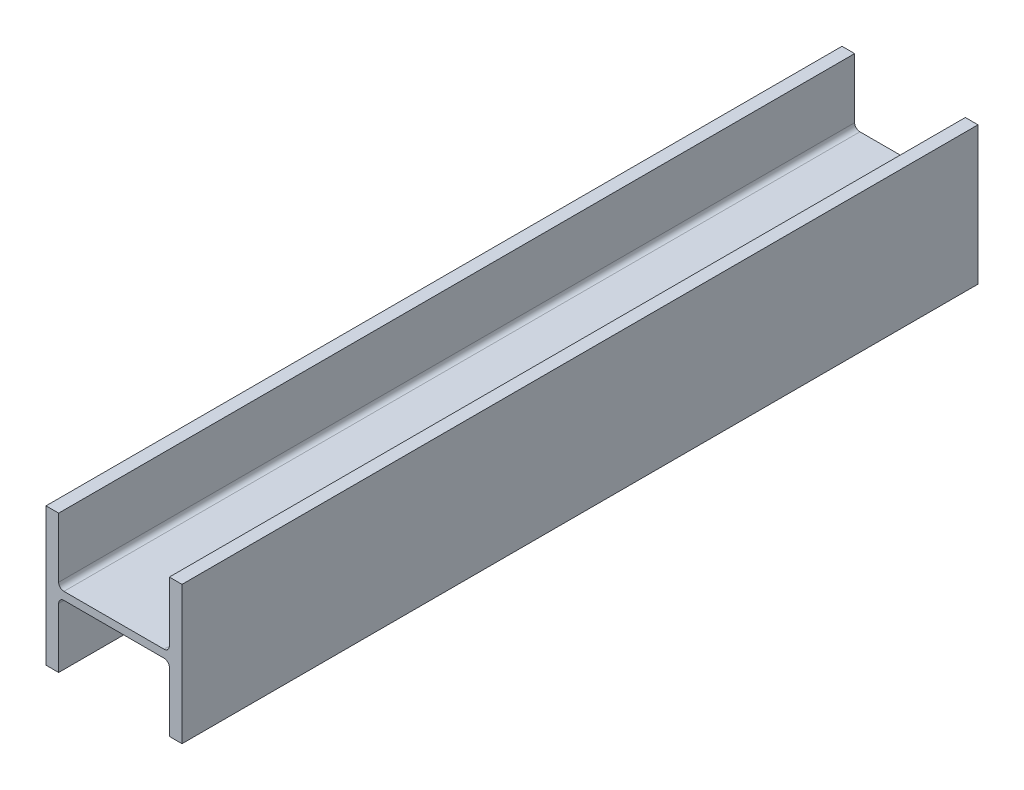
ISO-10303-21;
HEADER;
FILE_DESCRIPTION(('STEP AP214'),'2;1');
FILE_NAME('part.step','',(''),(''),'','','');
FILE_SCHEMA(('AUTOMOTIVE_DESIGN { 1 0 10303 214 1 1 1 1 }'));
ENDSEC;
DATA;
#1=APPLICATION_CONTEXT('core data for automotive mechanical design processes');
#2=APPLICATION_PROTOCOL_DEFINITION('international standard','automotive_design',2000,#1);
#3=PRODUCT_CONTEXT('',#1,'mechanical');
#4=PRODUCT('Part','Part','',(#3));
#5=PRODUCT_RELATED_PRODUCT_CATEGORY('part','',(#4));
#6=PRODUCT_DEFINITION_FORMATION('','',#4);
#7=PRODUCT_DEFINITION_CONTEXT('part definition',#1,'design');
#8=PRODUCT_DEFINITION('design','',#6,#7);
#9=PRODUCT_DEFINITION_SHAPE('','',#8);
#10=(LENGTH_UNIT() NAMED_UNIT(*) SI_UNIT(.MILLI.,.METRE.));
#11=(NAMED_UNIT(*) PLANE_ANGLE_UNIT() SI_UNIT($,.RADIAN.));
#12=(NAMED_UNIT(*) SI_UNIT($,.STERADIAN.) SOLID_ANGLE_UNIT());
#13=UNCERTAINTY_MEASURE_WITH_UNIT(LENGTH_MEASURE(1.E-05),#10,'distance_accuracy_value','');
#14=(GEOMETRIC_REPRESENTATION_CONTEXT(3) GLOBAL_UNCERTAINTY_ASSIGNED_CONTEXT((#13)) GLOBAL_UNIT_ASSIGNED_CONTEXT((#10,
#11,#12)) REPRESENTATION_CONTEXT('',''));
#15=CARTESIAN_POINT('',(0.,0.,0.));
#16=DIRECTION('',(0.,0.,1.));
#17=DIRECTION('',(1.,0.,0.));
#18=AXIS2_PLACEMENT_3D('',#15,#16,#17);
#19=CARTESIAN_POINT('',(196.596,199.517,1150.6));
#20=DIRECTION('',(-1.,0.,0.));
#21=DIRECTION('',(0.,0.,1.));
#22=AXIS2_PLACEMENT_3D('',#19,#20,#21);
#23=PLANE('',#22);
#24=DIRECTION('',(0.,1.,0.));
#25=VECTOR('',#24,1.);
#26=CARTESIAN_POINT('',(196.596,199.517,-1150.6));
#27=LINE('',#26,#25);
#28=CARTESIAN_POINT('',(196.596,-199.517,-1150.6));
#29=VERTEX_POINT('',#28);
#30=CARTESIAN_POINT('',(196.596,199.517,-1150.6));
#31=VERTEX_POINT('',#30);
#32=EDGE_CURVE('E191',#29,#31,#27,.T.);
#33=ORIENTED_EDGE('',*,*,#32,.T.);
#34=DIRECTION('',(0.,0.,-1.));
#35=VECTOR('',#34,1.);
#36=CARTESIAN_POINT('',(196.596,199.517,1150.6));
#37=LINE('',#36,#35);
#38=CARTESIAN_POINT('',(196.596,199.517,1150.6));
#39=VERTEX_POINT('',#38);
#40=EDGE_CURVE('E11',#39,#31,#37,.T.);
#41=ORIENTED_EDGE('',*,*,#40,.F.);
#42=DIRECTION('',(0.,1.,0.));
#43=VECTOR('',#42,1.);
#44=CARTESIAN_POINT('',(196.596,199.517,1150.6));
#45=LINE('',#44,#43);
#46=CARTESIAN_POINT('',(196.596,-199.517,1150.6));
#47=VERTEX_POINT('',#46);
#48=EDGE_CURVE('E238',#47,#39,#45,.T.);
#49=ORIENTED_EDGE('',*,*,#48,.F.);
#50=DIRECTION('',(0.,0.,-1.));
#51=VECTOR('',#50,1.);
#52=CARTESIAN_POINT('',(196.596,-199.517,1150.6));
#53=LINE('',#52,#51);
#54=EDGE_CURVE('E188',#47,#29,#53,.T.);
#55=ORIENTED_EDGE('',*,*,#54,.T.);
#56=EDGE_LOOP('',(#33,#41,#49,#55));
#57=FACE_BOUND('',#56,.T.);
#58=ADVANCED_FACE('F44',(#57),#23,.F.);
#59=CARTESIAN_POINT('',(160.02,199.517,1150.6));
#60=DIRECTION('',(0.,-1.,0.));
#61=DIRECTION('',(0.,0.,-1.));
#62=AXIS2_PLACEMENT_3D('',#59,#60,#61);
#63=PLANE('',#62);
#64=DIRECTION('',(-1.,0.,0.));
#65=VECTOR('',#64,1.);
#66=CARTESIAN_POINT('',(160.02,199.517,-1150.6));
#67=LINE('',#66,#65);
#68=CARTESIAN_POINT('',(160.02,199.517,-1150.6));
#69=VERTEX_POINT('',#68);
#70=EDGE_CURVE('E196',#31,#69,#67,.T.);
#71=ORIENTED_EDGE('',*,*,#70,.T.);
#72=DIRECTION('',(0.,0.,-1.));
#73=VECTOR('',#72,1.);
#74=CARTESIAN_POINT('',(160.02,199.517,1150.6));
#75=LINE('',#74,#73);
#76=CARTESIAN_POINT('',(160.02,199.517,1150.6));
#77=VERTEX_POINT('',#76);
#78=EDGE_CURVE('E53',#77,#69,#75,.T.);
#79=ORIENTED_EDGE('',*,*,#78,.F.);
#80=DIRECTION('',(-1.,0.,0.));
#81=VECTOR('',#80,1.);
#82=CARTESIAN_POINT('',(160.02,199.517,1150.6));
#83=LINE('',#82,#81);
#84=EDGE_CURVE('E129',#39,#77,#83,.T.);
#85=ORIENTED_EDGE('',*,*,#84,.F.);
#86=ORIENTED_EDGE('',*,*,#40,.T.);
#87=EDGE_LOOP('',(#71,#79,#85,#86));
#88=FACE_BOUND('',#87,.T.);
#89=ADVANCED_FACE('F362',(#88),#63,.F.);
#90=CARTESIAN_POINT('',(160.02,26.5430000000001,1150.6));
#91=DIRECTION('',(1.,0.,0.));
#92=DIRECTION('',(0.,0.,-1.));
#93=AXIS2_PLACEMENT_3D('',#90,#91,#92);
#94=PLANE('',#93);
#95=DIRECTION('',(0.,-1.,0.));
#96=VECTOR('',#95,1.);
#97=CARTESIAN_POINT('',(160.02,26.5430000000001,-1150.6));
#98=LINE('',#97,#96);
#99=CARTESIAN_POINT('',(160.02,26.5430000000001,-1150.6));
#100=VERTEX_POINT('',#99);
#101=EDGE_CURVE('E203',#69,#100,#98,.T.);
#102=ORIENTED_EDGE('',*,*,#101,.T.);
#103=DIRECTION('',(0.,0.,-1.));
#104=VECTOR('',#103,1.);
#105=CARTESIAN_POINT('',(160.02,26.5430000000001,1150.6));
#106=LINE('',#105,#104);
#107=CARTESIAN_POINT('',(160.02,26.5430000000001,1150.6));
#108=VERTEX_POINT('',#107);
#109=EDGE_CURVE('E285',#108,#100,#106,.T.);
#110=ORIENTED_EDGE('',*,*,#109,.F.);
#111=DIRECTION('',(0.,-1.,0.));
#112=VECTOR('',#111,1.);
#113=CARTESIAN_POINT('',(160.02,26.5430000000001,1150.6));
#114=LINE('',#113,#112);
#115=EDGE_CURVE('E291',#77,#108,#114,.T.);
#116=ORIENTED_EDGE('',*,*,#115,.F.);
#117=ORIENTED_EDGE('',*,*,#78,.T.);
#118=EDGE_LOOP('',(#102,#110,#116,#117));
#119=FACE_BOUND('',#118,.T.);
#120=ADVANCED_FACE('F292',(#119),#94,.F.);
#121=CARTESIAN_POINT('',(144.78,26.5430000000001,1150.6));
#122=DIRECTION('',(0.,0.,-1.));
#123=DIRECTION('',(-1.,0.,0.));
#124=AXIS2_PLACEMENT_3D('',#121,#122,#123);
#125=CYLINDRICAL_SURFACE('',#124,15.24);
#126=CARTESIAN_POINT('',(144.78,26.5430000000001,-1150.6));
#127=DIRECTION('',(0.,0.,-1.));
#128=DIRECTION('',(1.,0.,0.));
#129=AXIS2_PLACEMENT_3D('',#126,#127,#128);
#130=CIRCLE('',#129,15.24);
#131=CARTESIAN_POINT('',(144.78,11.3030000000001,-1150.6));
#132=VERTEX_POINT('',#131);
#133=EDGE_CURVE('E204',#100,#132,#130,.T.);
#134=ORIENTED_EDGE('',*,*,#133,.T.);
#135=DIRECTION('',(0.,0.,-1.));
#136=VECTOR('',#135,1.);
#137=CARTESIAN_POINT('',(144.78,11.3030000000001,1150.6));
#138=LINE('',#137,#136);
#139=CARTESIAN_POINT('',(144.78,11.3030000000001,1150.6));
#140=VERTEX_POINT('',#139);
#141=EDGE_CURVE('E276',#140,#132,#138,.T.);
#142=ORIENTED_EDGE('',*,*,#141,.F.);
#143=CARTESIAN_POINT('',(144.78,26.5430000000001,1150.6));
#144=DIRECTION('',(0.,0.,-1.));
#145=DIRECTION('',(1.,0.,0.));
#146=AXIS2_PLACEMENT_3D('',#143,#144,#145);
#147=CIRCLE('',#146,15.24);
#148=EDGE_CURVE('E315',#108,#140,#147,.T.);
#149=ORIENTED_EDGE('',*,*,#148,.F.);
#150=ORIENTED_EDGE('',*,*,#109,.T.);
#151=EDGE_LOOP('',(#134,#142,#149,#150));
#152=FACE_BOUND('',#151,.T.);
#153=ADVANCED_FACE('F304',(#152),#125,.F.);
#154=CARTESIAN_POINT('',(-144.78,11.3030000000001,1150.6));
#155=DIRECTION('',(0.,-1.,0.));
#156=DIRECTION('',(1.,0.,0.));
#157=AXIS2_PLACEMENT_3D('',#154,#155,#156);
#158=PLANE('',#157);
#159=DIRECTION('',(-1.,0.,0.));
#160=VECTOR('',#159,1.);
#161=CARTESIAN_POINT('',(-144.78,11.3030000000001,-1150.6));
#162=LINE('',#161,#160);
#163=CARTESIAN_POINT('',(-144.78,11.3030000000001,-1150.6));
#164=VERTEX_POINT('',#163);
#165=EDGE_CURVE('E210',#132,#164,#162,.T.);
#166=ORIENTED_EDGE('',*,*,#165,.T.);
#167=DIRECTION('',(0.,0.,-1.));
#168=VECTOR('',#167,1.);
#169=CARTESIAN_POINT('',(-144.78,11.3030000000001,1150.6));
#170=LINE('',#169,#168);
#171=CARTESIAN_POINT('',(-144.78,11.3030000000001,1150.6));
#172=VERTEX_POINT('',#171);
#173=EDGE_CURVE('E274',#172,#164,#170,.T.);
#174=ORIENTED_EDGE('',*,*,#173,.F.);
#175=DIRECTION('',(-1.,0.,0.));
#176=VECTOR('',#175,1.);
#177=CARTESIAN_POINT('',(-144.78,11.3030000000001,1150.6));
#178=LINE('',#177,#176);
#179=EDGE_CURVE('E306',#140,#172,#178,.T.);
#180=ORIENTED_EDGE('',*,*,#179,.F.);
#181=ORIENTED_EDGE('',*,*,#141,.T.);
#182=EDGE_LOOP('',(#166,#174,#180,#181));
#183=FACE_BOUND('',#182,.T.);
#184=ADVANCED_FACE('F308',(#183),#158,.F.);
#185=CARTESIAN_POINT('',(-144.78,26.5430000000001,1150.6));
#186=DIRECTION('',(0.,0.,-1.));
#187=DIRECTION('',(-1.,0.,0.));
#188=AXIS2_PLACEMENT_3D('',#185,#186,#187);
#189=CYLINDRICAL_SURFACE('',#188,15.24);
#190=CARTESIAN_POINT('',(-144.78,26.5430000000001,-1150.6));
#191=DIRECTION('',(0.,0.,-1.));
#192=DIRECTION('',(1.,0.,0.));
#193=AXIS2_PLACEMENT_3D('',#190,#191,#192);
#194=CIRCLE('',#193,15.24);
#195=CARTESIAN_POINT('',(-160.02,26.5430000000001,-1150.6));
#196=VERTEX_POINT('',#195);
#197=EDGE_CURVE('E209',#164,#196,#194,.T.);
#198=ORIENTED_EDGE('',*,*,#197,.T.);
#199=DIRECTION('',(0.,0.,-1.));
#200=VECTOR('',#199,1.);
#201=CARTESIAN_POINT('',(-160.02,26.5430000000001,1150.6));
#202=LINE('',#201,#200);
#203=CARTESIAN_POINT('',(-160.02,26.5430000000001,1150.6));
#204=VERTEX_POINT('',#203);
#205=EDGE_CURVE('E271',#204,#196,#202,.T.);
#206=ORIENTED_EDGE('',*,*,#205,.F.);
#207=CARTESIAN_POINT('',(-144.78,26.5430000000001,1150.6));
#208=DIRECTION('',(0.,0.,-1.));
#209=DIRECTION('',(1.,0.,0.));
#210=AXIS2_PLACEMENT_3D('',#207,#208,#209);
#211=CIRCLE('',#210,15.24);
#212=EDGE_CURVE('E313',#172,#204,#211,.T.);
#213=ORIENTED_EDGE('',*,*,#212,.F.);
#214=ORIENTED_EDGE('',*,*,#173,.T.);
#215=EDGE_LOOP('',(#198,#206,#213,#214));
#216=FACE_BOUND('',#215,.T.);
#217=ADVANCED_FACE('F374',(#216),#189,.F.);
#218=CARTESIAN_POINT('',(-160.02,199.517,1150.6));
#219=DIRECTION('',(-1.,0.,0.));
#220=DIRECTION('',(0.,0.,1.));
#221=AXIS2_PLACEMENT_3D('',#218,#219,#220);
#222=PLANE('',#221);
#223=DIRECTION('',(0.,1.,0.));
#224=VECTOR('',#223,1.);
#225=CARTESIAN_POINT('',(-160.02,199.517,-1150.6));
#226=LINE('',#225,#224);
#227=CARTESIAN_POINT('',(-160.02,199.517,-1150.6));
#228=VERTEX_POINT('',#227);
#229=EDGE_CURVE('E213',#196,#228,#226,.T.);
#230=ORIENTED_EDGE('',*,*,#229,.T.);
#231=DIRECTION('',(0.,0.,-1.));
#232=VECTOR('',#231,1.);
#233=CARTESIAN_POINT('',(-160.02,199.517,1150.6));
#234=LINE('',#233,#232);
#235=CARTESIAN_POINT('',(-160.02,199.517,1150.6));
#236=VERTEX_POINT('',#235);
#237=EDGE_CURVE('E270',#236,#228,#234,.T.);
#238=ORIENTED_EDGE('',*,*,#237,.F.);
#239=DIRECTION('',(0.,1.,0.));
#240=VECTOR('',#239,1.);
#241=CARTESIAN_POINT('',(-160.02,199.517,1150.6));
#242=LINE('',#241,#240);
#243=EDGE_CURVE('E316',#204,#236,#242,.T.);
#244=ORIENTED_EDGE('',*,*,#243,.F.);
#245=ORIENTED_EDGE('',*,*,#205,.T.);
#246=EDGE_LOOP('',(#230,#238,#244,#245));
#247=FACE_BOUND('',#246,.T.);
#248=ADVANCED_FACE('F378',(#247),#222,.F.);
#249=CARTESIAN_POINT('',(-196.596,199.517,1150.6));
#250=DIRECTION('',(0.,-1.,0.));
#251=DIRECTION('',(1.,0.,0.));
#252=AXIS2_PLACEMENT_3D('',#249,#250,#251);
#253=PLANE('',#252);
#254=DIRECTION('',(-1.,0.,0.));
#255=VECTOR('',#254,1.);
#256=CARTESIAN_POINT('',(-196.596,199.517,-1150.6));
#257=LINE('',#256,#255);
#258=CARTESIAN_POINT('',(-196.596,199.517,-1150.6));
#259=VERTEX_POINT('',#258);
#260=EDGE_CURVE('E216',#228,#259,#257,.T.);
#261=ORIENTED_EDGE('',*,*,#260,.T.);
#262=DIRECTION('',(0.,0.,-1.));
#263=VECTOR('',#262,1.);
#264=CARTESIAN_POINT('',(-196.596,199.517,1150.6));
#265=LINE('',#264,#263);
#266=CARTESIAN_POINT('',(-196.596,199.517,1150.6));
#267=VERTEX_POINT('',#266);
#268=EDGE_CURVE('E263',#267,#259,#265,.T.);
#269=ORIENTED_EDGE('',*,*,#268,.F.);
#270=DIRECTION('',(-1.,0.,0.));
#271=VECTOR('',#270,1.);
#272=CARTESIAN_POINT('',(-196.596,199.517,1150.6));
#273=LINE('',#272,#271);
#274=EDGE_CURVE('E323',#236,#267,#273,.T.);
#275=ORIENTED_EDGE('',*,*,#274,.F.);
#276=ORIENTED_EDGE('',*,*,#237,.T.);
#277=EDGE_LOOP('',(#261,#269,#275,#276));
#278=FACE_BOUND('',#277,.T.);
#279=ADVANCED_FACE('F385',(#278),#253,.F.);
#280=CARTESIAN_POINT('',(-196.596,-199.517,1150.6));
#281=DIRECTION('',(1.,0.,0.));
#282=DIRECTION('',(0.,0.,-1.));
#283=AXIS2_PLACEMENT_3D('',#280,#281,#282);
#284=PLANE('',#283);
#285=DIRECTION('',(0.,-1.,0.));
#286=VECTOR('',#285,1.);
#287=CARTESIAN_POINT('',(-196.596,-199.517,-1150.6));
#288=LINE('',#287,#286);
#289=CARTESIAN_POINT('',(-196.596,-199.517,-1150.6));
#290=VERTEX_POINT('',#289);
#291=EDGE_CURVE('E218',#259,#290,#288,.T.);
#292=ORIENTED_EDGE('',*,*,#291,.T.);
#293=DIRECTION('',(0.,0.,-1.));
#294=VECTOR('',#293,1.);
#295=CARTESIAN_POINT('',(-196.596,-199.517,1150.6));
#296=LINE('',#295,#294);
#297=CARTESIAN_POINT('',(-196.596,-199.517,1150.6));
#298=VERTEX_POINT('',#297);
#299=EDGE_CURVE('E259',#298,#290,#296,.T.);
#300=ORIENTED_EDGE('',*,*,#299,.F.);
#301=DIRECTION('',(0.,-1.,0.));
#302=VECTOR('',#301,1.);
#303=CARTESIAN_POINT('',(-196.596,-199.517,1150.6));
#304=LINE('',#303,#302);
#305=EDGE_CURVE('E326',#267,#298,#304,.T.);
#306=ORIENTED_EDGE('',*,*,#305,.F.);
#307=ORIENTED_EDGE('',*,*,#268,.T.);
#308=EDGE_LOOP('',(#292,#300,#306,#307));
#309=FACE_BOUND('',#308,.T.);
#310=ADVANCED_FACE('F387',(#309),#284,.F.);
#311=CARTESIAN_POINT('',(-160.02,-199.517,1150.6));
#312=DIRECTION('',(0.,1.,0.));
#313=DIRECTION('',(0.,0.,1.));
#314=AXIS2_PLACEMENT_3D('',#311,#312,#313);
#315=PLANE('',#314);
#316=DIRECTION('',(1.,0.,0.));
#317=VECTOR('',#316,1.);
#318=CARTESIAN_POINT('',(-160.02,-199.517,-1150.6));
#319=LINE('',#318,#317);
#320=CARTESIAN_POINT('',(-160.02,-199.517,-1150.6));
#321=VERTEX_POINT('',#320);
#322=EDGE_CURVE('E225',#290,#321,#319,.T.);
#323=ORIENTED_EDGE('',*,*,#322,.T.);
#324=DIRECTION('',(0.,0.,-1.));
#325=VECTOR('',#324,1.);
#326=CARTESIAN_POINT('',(-160.02,-199.517,1150.6));
#327=LINE('',#326,#325);
#328=CARTESIAN_POINT('',(-160.02,-199.517,1150.6));
#329=VERTEX_POINT('',#328);
#330=EDGE_CURVE('E254',#329,#321,#327,.T.);
#331=ORIENTED_EDGE('',*,*,#330,.F.);
#332=DIRECTION('',(1.,0.,0.));
#333=VECTOR('',#332,1.);
#334=CARTESIAN_POINT('',(-160.02,-199.517,1150.6));
#335=LINE('',#334,#333);
#336=EDGE_CURVE('E328',#298,#329,#335,.T.);
#337=ORIENTED_EDGE('',*,*,#336,.F.);
#338=ORIENTED_EDGE('',*,*,#299,.T.);
#339=EDGE_LOOP('',(#323,#331,#337,#338));
#340=FACE_BOUND('',#339,.T.);
#341=ADVANCED_FACE('F388',(#340),#315,.F.);
#342=CARTESIAN_POINT('',(-160.02,-26.5429999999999,1150.6));
#343=DIRECTION('',(-1.,0.,0.));
#344=DIRECTION('',(0.,0.,1.));
#345=AXIS2_PLACEMENT_3D('',#342,#343,#344);
#346=PLANE('',#345);
#347=DIRECTION('',(0.,1.,0.));
#348=VECTOR('',#347,1.);
#349=CARTESIAN_POINT('',(-160.02,-26.5429999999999,-1150.6));
#350=LINE('',#349,#348);
#351=CARTESIAN_POINT('',(-160.02,-26.5429999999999,-1150.6));
#352=VERTEX_POINT('',#351);
#353=EDGE_CURVE('E223',#321,#352,#350,.T.);
#354=ORIENTED_EDGE('',*,*,#353,.T.);
#355=DIRECTION('',(0.,0.,-1.));
#356=VECTOR('',#355,1.);
#357=CARTESIAN_POINT('',(-160.02,-26.5429999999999,1150.6));
#358=LINE('',#357,#356);
#359=CARTESIAN_POINT('',(-160.02,-26.5429999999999,1150.6));
#360=VERTEX_POINT('',#359);
#361=EDGE_CURVE('E253',#360,#352,#358,.T.);
#362=ORIENTED_EDGE('',*,*,#361,.F.);
#363=DIRECTION('',(0.,1.,0.));
#364=VECTOR('',#363,1.);
#365=CARTESIAN_POINT('',(-160.02,-26.5429999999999,1150.6));
#366=LINE('',#365,#364);
#367=EDGE_CURVE('E335',#329,#360,#366,.T.);
#368=ORIENTED_EDGE('',*,*,#367,.F.);
#369=ORIENTED_EDGE('',*,*,#330,.T.);
#370=EDGE_LOOP('',(#354,#362,#368,#369));
#371=FACE_BOUND('',#370,.T.);
#372=ADVANCED_FACE('F391',(#371),#346,.F.);
#373=CARTESIAN_POINT('',(-144.78,-26.5429999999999,1150.6));
#374=DIRECTION('',(0.,0.,-1.));
#375=DIRECTION('',(-1.,0.,0.));
#376=AXIS2_PLACEMENT_3D('',#373,#374,#375);
#377=CYLINDRICAL_SURFACE('',#376,15.24);
#378=CARTESIAN_POINT('',(-144.78,-26.5429999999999,-1150.6));
#379=DIRECTION('',(0.,0.,-1.));
#380=DIRECTION('',(1.,0.,0.));
#381=AXIS2_PLACEMENT_3D('',#378,#379,#380);
#382=CIRCLE('',#381,15.24);
#383=CARTESIAN_POINT('',(-144.78,-11.3029999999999,-1150.6));
#384=VERTEX_POINT('',#383);
#385=EDGE_CURVE('E230',#352,#384,#382,.T.);
#386=ORIENTED_EDGE('',*,*,#385,.T.);
#387=DIRECTION('',(0.,0.,-1.));
#388=VECTOR('',#387,1.);
#389=CARTESIAN_POINT('',(-144.78,-11.3029999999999,1150.6));
#390=LINE('',#389,#388);
#391=CARTESIAN_POINT('',(-144.78,-11.3029999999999,1150.6));
#392=VERTEX_POINT('',#391);
#393=EDGE_CURVE('E249',#392,#384,#390,.T.);
#394=ORIENTED_EDGE('',*,*,#393,.F.);
#395=CARTESIAN_POINT('',(-144.78,-26.5429999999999,1150.6));
#396=DIRECTION('',(0.,0.,-1.));
#397=DIRECTION('',(1.,0.,0.));
#398=AXIS2_PLACEMENT_3D('',#395,#396,#397);
#399=CIRCLE('',#398,15.24);
#400=EDGE_CURVE('E333',#360,#392,#399,.T.);
#401=ORIENTED_EDGE('',*,*,#400,.F.);
#402=ORIENTED_EDGE('',*,*,#361,.T.);
#403=EDGE_LOOP('',(#386,#394,#401,#402));
#404=FACE_BOUND('',#403,.T.);
#405=ADVANCED_FACE('F345',(#404),#377,.F.);
#406=CARTESIAN_POINT('',(144.78,-11.3029999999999,1150.6));
#407=DIRECTION('',(0.,1.,0.));
#408=DIRECTION('',(0.,0.,1.));
#409=AXIS2_PLACEMENT_3D('',#406,#407,#408);
#410=PLANE('',#409);
#411=DIRECTION('',(1.,0.,0.));
#412=VECTOR('',#411,1.);
#413=CARTESIAN_POINT('',(144.78,-11.3029999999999,-1150.6));
#414=LINE('',#413,#412);
#415=CARTESIAN_POINT('',(144.78,-11.3029999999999,-1150.6));
#416=VERTEX_POINT('',#415);
#417=EDGE_CURVE('E232',#384,#416,#414,.T.);
#418=ORIENTED_EDGE('',*,*,#417,.T.);
#419=DIRECTION('',(0.,0.,-1.));
#420=VECTOR('',#419,1.);
#421=CARTESIAN_POINT('',(144.78,-11.3029999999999,1150.6));
#422=LINE('',#421,#420);
#423=CARTESIAN_POINT('',(144.78,-11.3029999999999,1150.6));
#424=VERTEX_POINT('',#423);
#425=EDGE_CURVE('E181',#424,#416,#422,.T.);
#426=ORIENTED_EDGE('',*,*,#425,.F.);
#427=DIRECTION('',(1.,0.,0.));
#428=VECTOR('',#427,1.);
#429=CARTESIAN_POINT('',(144.78,-11.3029999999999,1150.6));
#430=LINE('',#429,#428);
#431=EDGE_CURVE('E174',#392,#424,#430,.T.);
#432=ORIENTED_EDGE('',*,*,#431,.F.);
#433=ORIENTED_EDGE('',*,*,#393,.T.);
#434=EDGE_LOOP('',(#418,#426,#432,#433));
#435=FACE_BOUND('',#434,.T.);
#436=ADVANCED_FACE('F350',(#435),#410,.F.);
#437=CARTESIAN_POINT('',(144.78,-26.5429999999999,1150.6));
#438=DIRECTION('',(0.,0.,-1.));
#439=DIRECTION('',(-1.,0.,0.));
#440=AXIS2_PLACEMENT_3D('',#437,#438,#439);
#441=CYLINDRICAL_SURFACE('',#440,15.24);
#442=CARTESIAN_POINT('',(144.78,-26.5429999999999,-1150.6));
#443=DIRECTION('',(0.,0.,-1.));
#444=DIRECTION('',(1.,0.,0.));
#445=AXIS2_PLACEMENT_3D('',#442,#443,#444);
#446=CIRCLE('',#445,15.24);
#447=CARTESIAN_POINT('',(160.02,-26.5429999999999,-1150.6));
#448=VERTEX_POINT('',#447);
#449=EDGE_CURVE('E182',#416,#448,#446,.T.);
#450=ORIENTED_EDGE('',*,*,#449,.T.);
#451=DIRECTION('',(0.,0.,-1.));
#452=VECTOR('',#451,1.);
#453=CARTESIAN_POINT('',(160.02,-26.5429999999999,1150.6));
#454=LINE('',#453,#452);
#455=CARTESIAN_POINT('',(160.02,-26.5429999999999,1150.6));
#456=VERTEX_POINT('',#455);
#457=EDGE_CURVE('E180',#456,#448,#454,.T.);
#458=ORIENTED_EDGE('',*,*,#457,.F.);
#459=CARTESIAN_POINT('',(144.78,-26.5429999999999,1150.6));
#460=DIRECTION('',(0.,0.,-1.));
#461=DIRECTION('',(1.,0.,0.));
#462=AXIS2_PLACEMENT_3D('',#459,#460,#461);
#463=CIRCLE('',#462,15.24);
#464=EDGE_CURVE('E167',#424,#456,#463,.T.);
#465=ORIENTED_EDGE('',*,*,#464,.F.);
#466=ORIENTED_EDGE('',*,*,#425,.T.);
#467=EDGE_LOOP('',(#450,#458,#465,#466));
#468=FACE_BOUND('',#467,.T.);
#469=ADVANCED_FACE('F176',(#468),#441,.F.);
#470=CARTESIAN_POINT('',(160.02,-199.517,1150.6));
#471=DIRECTION('',(1.,0.,0.));
#472=DIRECTION('',(0.,0.,-1.));
#473=AXIS2_PLACEMENT_3D('',#470,#471,#472);
#474=PLANE('',#473);
#475=DIRECTION('',(0.,-1.,0.));
#476=VECTOR('',#475,1.);
#477=CARTESIAN_POINT('',(160.02,-199.517,-1150.6));
#478=LINE('',#477,#476);
#479=CARTESIAN_POINT('',(160.02,-199.517,-1150.6));
#480=VERTEX_POINT('',#479);
#481=EDGE_CURVE('E113',#448,#480,#478,.T.);
#482=ORIENTED_EDGE('',*,*,#481,.T.);
#483=DIRECTION('',(0.,0.,-1.));
#484=VECTOR('',#483,1.);
#485=CARTESIAN_POINT('',(160.02,-199.517,1150.6));
#486=LINE('',#485,#484);
#487=CARTESIAN_POINT('',(160.02,-199.517,1150.6));
#488=VERTEX_POINT('',#487);
#489=EDGE_CURVE('E184',#488,#480,#486,.T.);
#490=ORIENTED_EDGE('',*,*,#489,.F.);
#491=DIRECTION('',(0.,-1.,0.));
#492=VECTOR('',#491,1.);
#493=CARTESIAN_POINT('',(160.02,-199.517,1150.6));
#494=LINE('',#493,#492);
#495=EDGE_CURVE('E168',#456,#488,#494,.T.);
#496=ORIENTED_EDGE('',*,*,#495,.F.);
#497=ORIENTED_EDGE('',*,*,#457,.T.);
#498=EDGE_LOOP('',(#482,#490,#496,#497));
#499=FACE_BOUND('',#498,.T.);
#500=ADVANCED_FACE('F187',(#499),#474,.F.);
#501=CARTESIAN_POINT('',(196.596,-199.517,1150.6));
#502=DIRECTION('',(0.,1.,0.));
#503=DIRECTION('',(0.,0.,1.));
#504=AXIS2_PLACEMENT_3D('',#501,#502,#503);
#505=PLANE('',#504);
#506=DIRECTION('',(1.,0.,0.));
#507=VECTOR('',#506,1.);
#508=CARTESIAN_POINT('',(196.596,-199.517,-1150.6));
#509=LINE('',#508,#507);
#510=EDGE_CURVE('E122',#480,#29,#509,.T.);
#511=ORIENTED_EDGE('',*,*,#510,.T.);
#512=ORIENTED_EDGE('',*,*,#54,.F.);
#513=DIRECTION('',(1.,0.,0.));
#514=VECTOR('',#513,1.);
#515=CARTESIAN_POINT('',(196.596,-199.517,1150.6));
#516=LINE('',#515,#514);
#517=EDGE_CURVE('E64',#488,#47,#516,.T.);
#518=ORIENTED_EDGE('',*,*,#517,.F.);
#519=ORIENTED_EDGE('',*,*,#489,.T.);
#520=EDGE_LOOP('',(#511,#512,#518,#519));
#521=FACE_BOUND('',#520,.T.);
#522=ADVANCED_FACE('F352',(#521),#505,.F.);
#523=CARTESIAN_POINT('',(144.78,-26.5429999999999,1150.6));
#524=DIRECTION('',(0.,0.,1.));
#525=DIRECTION('',(1.,0.,0.));
#526=AXIS2_PLACEMENT_3D('',#523,#524,#525);
#527=PLANE('',#526);
#528=ORIENTED_EDGE('',*,*,#48,.T.);
#529=ORIENTED_EDGE('',*,*,#84,.T.);
#530=ORIENTED_EDGE('',*,*,#115,.T.);
#531=ORIENTED_EDGE('',*,*,#148,.T.);
#532=ORIENTED_EDGE('',*,*,#179,.T.);
#533=ORIENTED_EDGE('',*,*,#212,.T.);
#534=ORIENTED_EDGE('',*,*,#243,.T.);
#535=ORIENTED_EDGE('',*,*,#274,.T.);
#536=ORIENTED_EDGE('',*,*,#305,.T.);
#537=ORIENTED_EDGE('',*,*,#336,.T.);
#538=ORIENTED_EDGE('',*,*,#367,.T.);
#539=ORIENTED_EDGE('',*,*,#400,.T.);
#540=ORIENTED_EDGE('',*,*,#431,.T.);
#541=ORIENTED_EDGE('',*,*,#464,.T.);
#542=ORIENTED_EDGE('',*,*,#495,.T.);
#543=ORIENTED_EDGE('',*,*,#517,.T.);
#544=EDGE_LOOP('',(#528,#529,#530,#531,#532,#533,#534,#535,#536,#537,#538,#539,#540,#541,#542,#543));
#545=FACE_BOUND('',#544,.T.);
#546=ADVANCED_FACE('F169',(#545),#527,.T.);
#547=CARTESIAN_POINT('',(144.78,-26.5429999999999,-1150.6));
#548=DIRECTION('',(0.,0.,1.));
#549=DIRECTION('',(1.,0.,0.));
#550=AXIS2_PLACEMENT_3D('',#547,#548,#549);
#551=PLANE('',#550);
#552=ORIENTED_EDGE('',*,*,#32,.F.);
#553=ORIENTED_EDGE('',*,*,#510,.F.);
#554=ORIENTED_EDGE('',*,*,#481,.F.);
#555=ORIENTED_EDGE('',*,*,#449,.F.);
#556=ORIENTED_EDGE('',*,*,#417,.F.);
#557=ORIENTED_EDGE('',*,*,#385,.F.);
#558=ORIENTED_EDGE('',*,*,#353,.F.);
#559=ORIENTED_EDGE('',*,*,#322,.F.);
#560=ORIENTED_EDGE('',*,*,#291,.F.);
#561=ORIENTED_EDGE('',*,*,#260,.F.);
#562=ORIENTED_EDGE('',*,*,#229,.F.);
#563=ORIENTED_EDGE('',*,*,#197,.F.);
#564=ORIENTED_EDGE('',*,*,#165,.F.);
#565=ORIENTED_EDGE('',*,*,#133,.F.);
#566=ORIENTED_EDGE('',*,*,#101,.F.);
#567=ORIENTED_EDGE('',*,*,#70,.F.);
#568=EDGE_LOOP('',(#552,#553,#554,#555,#556,#557,#558,#559,#560,#561,#562,#563,#564,#565,#566,#567));
#569=FACE_BOUND('',#568,.T.);
#570=ADVANCED_FACE('F299',(#569),#551,.F.);
#571=CLOSED_SHELL('',(#58,#89,#120,#153,#184,#217,#248,#279,#310,#341,#372,#405,#436,#469,#500,
#522,#546,#570));
#572=MANIFOLD_SOLID_BREP('B2',#571);
#573=ADVANCED_BREP_SHAPE_REPRESENTATION('',(#18,#572),#14);
#574=SHAPE_DEFINITION_REPRESENTATION(#9,#573);
ENDSEC;
END-ISO-10303-21;
